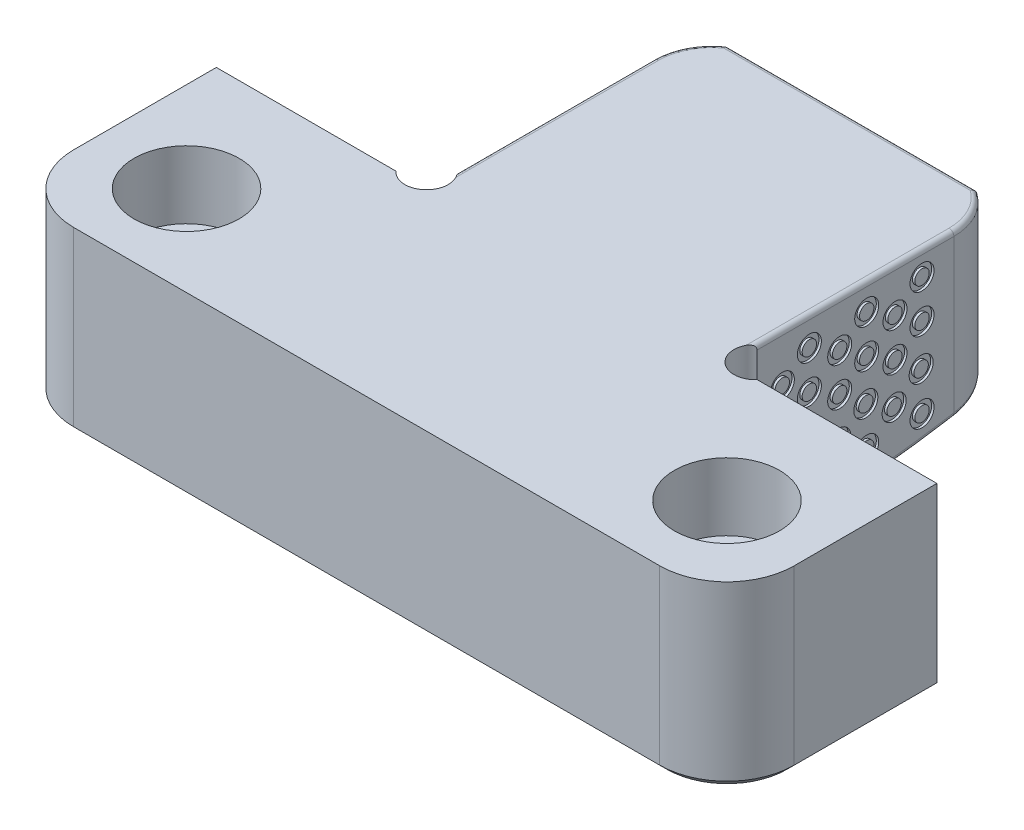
from build123d import *

# Parameters (mm, degrees)
BOSS_EXTRUDE1_DEPTH     = 19.0246
CUT_EXTRUDE1_DEPTH      = 52.583372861
SKETCH3_R               = 2.286
CUT_EXTRUDE2_DEPTH      = 52.583372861
CUT_EXTRUDE3_DEPTH      = 84.759622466
FILLET1_R               = 7.112
FILLET2_R               = 0.508
CHAMFER3_SIZE           = 0.762
F_1_4_CBORE_D           = 6.7564
F_1_4_CBORE_CBORE_D     = 11.1125
F_1_4_CBORE_CBORE_DEPTH = 7.14375
SKETCH8_R               = 1.27
SKETCH8_R_2             = 0.762
CUT_EXTRUDE4_DEPTH      = 0.254


with BuildPart() as part:
    # Sketch1 → Boss-Extrude1 (new body)
    with BuildSketch(Plane(origin=(0, 0, 0), x_dir=(1, 0, 0), z_dir=(0, 1, 0))):
        Polygon((-38.1, -22.1996), (38.1, -22.1996), (38.1, 0), (15.87246, 0), (15.87246, 29.1084), (-15.87246, 29.1084), (-15.87246, 0), (-38.1, 0), align=None)
    extrude(amount=-BOSS_EXTRUDE1_DEPTH)

    # Sketch2 → Cut-Extrude1 (cut, through all)
    with BuildSketch(Plane(origin=(0, 0, 0), x_dir=(1, 0, 0), z_dir=(0, 1, 0))):
        with BuildLine():
            Line((15.87246, 22.7584), (15.87246, 24.0284))
            ThreePointArc((15.87246, 24.0284), (15.164947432, 26.897353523), (13.20465617, 29.1084))
            Line((13.20465617, 29.1084), (-13.20465617, 29.1084))
            ThreePointArc((-13.20465617, 29.1084), (-15.164947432, 26.897353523), (-15.87246, 24.0284))
            Line((-15.87246, 24.0284), (-15.87246, 22.7584))
            Line((-15.87246, 22.7584), (-25.4, 22.7584))
            Line((-25.4, 22.7584), (-25.4, 35.4584))
            Line((-25.4, 35.4584), (25.4, 35.4584))
            Line((25.4, 35.4584), (25.4, 22.7584))
            Line((25.4, 22.7584), (15.87246, 22.7584))
        make_face()
    extrude(amount=-CUT_EXTRUDE1_DEPTH, mode=Mode.SUBTRACT)

    # Sketch3 → Cut-Extrude2 (cut, through all)
    with BuildSketch(Plane(origin=(0, 0, 0), x_dir=(1, 0, 0), z_dir=(0, 1, 0))):
        with Locations((17.39646, 1.524)):
            Circle(SKETCH3_R)
        with Locations((-17.39646, 1.524)):
            Circle(SKETCH3_R)
    extrude(amount=-CUT_EXTRUDE2_DEPTH, mode=Mode.SUBTRACT)

    # Sketch5 → Cut-Extrude3 (cut, through all)
    with BuildSketch(Plane(origin=(38.1, 0, 0), x_dir=(0, 0, -1), z_dir=(1, 0, 0))):
        with BuildLine():
            Line((0, -18.7706), (0, -47.283879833))
            Line((0, -47.283879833), (50.8, -47.283879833))
            Line((50.8, -47.283879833), (50.8, -9.183879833))
            ThreePointArc((50.8, -9.183879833), (28.385259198, -16.348251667), (4.9784, -18.7706))
            Line((4.9784, -18.7706), (0, -18.7706))
        make_face()
    extrude(amount=-CUT_EXTRUDE3_DEPTH, mode=Mode.SUBTRACT)

    # Fillet1
    fillet1_edges = [part.edges().sort_by_distance(p)[0] for p in [
        (38.1, -9.5123, 22.1996),
        (-38.1, -9.5123, 22.1996),
    ]]
    fillet(fillet1_edges, radius=FILLET1_R)

    # Fillet2
    fillet2_edges = [part.edges().sort_by_distance(p)[0] for p in [
        (0, 0, -29.1084),
        (-15.87246, 0, -13.628141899),
        (-15.164947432, 0, -26.897353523),
        (15.164947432, 0, -26.897353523),
        (15.87246, 0, -13.628141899),
        (15.167390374, -16.650159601, -26.892696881),
        (-15.87246, -18.370228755, -14.53688155),
        (0, -16.194514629, -29.1084),
        (15.87246, -18.370228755, -14.53688155),
        (15.87246, -18.7706, -4.103141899),
        (-15.87246, -18.7706, -4.103141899),
        (-15.167390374, -16.650159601, -26.892696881),
    ]]
    fillet(fillet2_edges, radius=FILLET2_R)

    # Chamfer3
    chamfer3_edges = [part.edges().sort_by_distance(p)[0] for p in [
        (0, -19.0246, 22.1996),
        (38.1, -19.0246, 7.5438),
        (36.016943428, -19.0246, 20.116543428),
        (-36.016943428, -19.0246, 20.116543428),
        (-38.1, -19.0246, 7.5438),
    ]]
    chamfer(chamfer3_edges, length=CHAMFER3_SIZE)

    # 1_4_ CBORE (through all)
    with Locations(Plane(origin=(0, 0, 0), x_dir=(-1, 0, 0), z_dir=(0, 1, 0))):
        with Locations((28.575, 12.6746), (-28.575, 12.6746)):
            CounterBoreHole(F_1_4_CBORE_D / 2, F_1_4_CBORE_CBORE_D / 2, F_1_4_CBORE_CBORE_DEPTH)

    # Sketch8 → Cut-Extrude4 (cut)
    # profile 1 of 21: a face of its own
    with BuildSketch(Plane(origin=(15.87246, 0, 0), x_dir=(0, 0, -1), z_dir=(1, 0, 0))):
        with Locations((20.659548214, -2.541638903)):
            Circle(SKETCH8_R)
        with Locations((20.659548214, -2.541638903)):
            Circle(SKETCH8_R_2, mode=Mode.SUBTRACT)
    # profile 2 of 21: a face of its own
    with BuildSketch(Plane(origin=(15.87246, 0, 0), x_dir=(0, 0, -1), z_dir=(1, 0, 0))):
        with Locations((20.659548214, -15.078409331)):
            Circle(SKETCH8_R)
        with Locations((20.659548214, -15.078409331)):
            Circle(SKETCH8_R_2, mode=Mode.SUBTRACT)
    # profile 3 of 21: a face of its own
    with BuildSketch(Plane(origin=(15.87246, 0, 0), x_dir=(0, 0, -1), z_dir=(1, 0, 0))):
        with Locations((20.564931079, -10.915255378)):
            Circle(SKETCH8_R)
        with Locations((20.564931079, -10.915255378)):
            Circle(SKETCH8_R_2, mode=Mode.SUBTRACT)
    # profile 4 of 21: a face of its own
    with BuildSketch(Plane(origin=(15.87246, 0, 0), x_dir=(0, 0, -1), z_dir=(1, 0, 0))):
        with Locations((20.659548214, -6.610175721)):
            Circle(SKETCH8_R)
        with Locations((20.659548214, -6.610175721)):
            Circle(SKETCH8_R_2, mode=Mode.SUBTRACT)
    # profile 5 of 21: a face of its own
    with BuildSketch(Plane(origin=(15.87246, 0, 0), x_dir=(0, 0, -1), z_dir=(1, 0, 0))):
        with Locations((17.800309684, -4.616657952)):
            Circle(SKETCH8_R)
        with Locations((17.800309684, -4.616657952)):
            Circle(SKETCH8_R_2, mode=Mode.SUBTRACT)
    # profile 6 of 21: a face of its own
    with BuildSketch(Plane(origin=(15.87246, 0, 0), x_dir=(0, 0, -1), z_dir=(1, 0, 0))):
        with Locations((14.808726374, -2.819984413)):
            Circle(SKETCH8_R)
        with Locations((14.808726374, -2.819984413)):
            Circle(SKETCH8_R_2, mode=Mode.SUBTRACT)
    # profile 7 of 21: a face of its own
    with BuildSketch(Plane(origin=(15.87246, 0, 0), x_dir=(0, 0, -1), z_dir=(1, 0, 0))):
        with Locations((17.705692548, -12.990274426)):
            Circle(SKETCH8_R)
        with Locations((17.705692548, -12.990274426)):
            Circle(SKETCH8_R_2, mode=Mode.SUBTRACT)
    # profile 8 of 21: a face of its own
    with BuildSketch(Plane(origin=(15.87246, 0, 0), x_dir=(0, 0, -1), z_dir=(1, 0, 0))):
        with Locations((17.800309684, -8.68519477)):
            Circle(SKETCH8_R)
        with Locations((17.800309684, -8.68519477)):
            Circle(SKETCH8_R_2, mode=Mode.SUBTRACT)
    # profile 9 of 21: a face of its own
    with BuildSketch(Plane(origin=(15.87246, 0, 0), x_dir=(0, 0, -1), z_dir=(1, 0, 0))):
        with Locations((14.808726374, -15.356754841)):
            Circle(SKETCH8_R)
        with Locations((14.808726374, -15.356754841)):
            Circle(SKETCH8_R_2, mode=Mode.SUBTRACT)
    # profile 10 of 21: a face of its own
    with BuildSketch(Plane(origin=(15.87246, 0, 0), x_dir=(0, 0, -1), z_dir=(1, 0, 0))):
        with Locations((14.714109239, -11.193600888)):
            Circle(SKETCH8_R)
        with Locations((14.714109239, -11.193600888)):
            Circle(SKETCH8_R_2, mode=Mode.SUBTRACT)
    # profile 11 of 21: a face of its own
    with BuildSketch(Plane(origin=(15.87246, 0, 0), x_dir=(0, 0, -1), z_dir=(1, 0, 0))):
        with Locations((14.808726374, -6.888521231)):
            Circle(SKETCH8_R)
        with Locations((14.808726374, -6.888521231)):
            Circle(SKETCH8_R_2, mode=Mode.SUBTRACT)
    # profile 12 of 21: a face of its own
    with BuildSketch(Plane(origin=(15.87246, 0, 0), x_dir=(0, 0, -1), z_dir=(1, 0, 0))):
        with Locations((11.949487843, -4.895003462)):
            Circle(SKETCH8_R)
        with Locations((11.949487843, -4.895003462)):
            Circle(SKETCH8_R_2, mode=Mode.SUBTRACT)
    # profile 13 of 21: a face of its own
    with BuildSketch(Plane(origin=(15.87246, 0, 0), x_dir=(0, 0, -1), z_dir=(1, 0, 0))):
        with Locations((11.854870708, -13.268619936)):
            Circle(SKETCH8_R)
        with Locations((11.854870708, -13.268619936)):
            Circle(SKETCH8_R_2, mode=Mode.SUBTRACT)
    # profile 14 of 21: a face of its own
    with BuildSketch(Plane(origin=(15.87246, 0, 0), x_dir=(0, 0, -1), z_dir=(1, 0, 0))):
        with Locations((11.949487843, -8.96354028)):
            Circle(SKETCH8_R)
        with Locations((11.949487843, -8.96354028)):
            Circle(SKETCH8_R_2, mode=Mode.SUBTRACT)
    # profile 15 of 21: a face of its own
    with BuildSketch(Plane(origin=(15.87246, 0, 0), x_dir=(0, 0, -1), z_dir=(1, 0, 0))):
        with Locations((8.743678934, -3.074561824)):
            Circle(SKETCH8_R)
        with Locations((8.743678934, -3.074561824)):
            Circle(SKETCH8_R_2, mode=Mode.SUBTRACT)
    # profile 16 of 21: a face of its own
    with BuildSketch(Plane(origin=(15.87246, 0, 0), x_dir=(0, 0, -1), z_dir=(1, 0, 0))):
        with Locations((8.743678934, -15.611332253)):
            Circle(SKETCH8_R)
        with Locations((8.743678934, -15.611332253)):
            Circle(SKETCH8_R_2, mode=Mode.SUBTRACT)
    # profile 17 of 21: a face of its own
    with BuildSketch(Plane(origin=(15.87246, 0, 0), x_dir=(0, 0, -1), z_dir=(1, 0, 0))):
        with Locations((8.649061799, -11.448178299)):
            Circle(SKETCH8_R)
        with Locations((8.649061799, -11.448178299)):
            Circle(SKETCH8_R_2, mode=Mode.SUBTRACT)
    # profile 18 of 21: a face of its own
    with BuildSketch(Plane(origin=(15.87246, 0, 0), x_dir=(0, 0, -1), z_dir=(1, 0, 0))):
        with Locations((8.743678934, -7.143098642)):
            Circle(SKETCH8_R)
        with Locations((8.743678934, -7.143098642)):
            Circle(SKETCH8_R_2, mode=Mode.SUBTRACT)
    # profile 19 of 21: a face of its own
    with BuildSketch(Plane(origin=(15.87246, 0, 0), x_dir=(0, 0, -1), z_dir=(1, 0, 0))):
        with Locations((5.884440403, -5.149580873)):
            Circle(SKETCH8_R)
        with Locations((5.884440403, -5.149580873)):
            Circle(SKETCH8_R_2, mode=Mode.SUBTRACT)
    # profile 20 of 21: a face of its own
    with BuildSketch(Plane(origin=(15.87246, 0, 0), x_dir=(0, 0, -1), z_dir=(1, 0, 0))):
        with Locations((5.789823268, -13.523197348)):
            Circle(SKETCH8_R)
        with Locations((5.789823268, -13.523197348)):
            Circle(SKETCH8_R_2, mode=Mode.SUBTRACT)
    # profile 21 of 21: a face of its own
    with BuildSketch(Plane(origin=(15.87246, 0, 0), x_dir=(0, 0, -1), z_dir=(1, 0, 0))):
        with Locations((5.884440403, -9.218117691)):
            Circle(SKETCH8_R)
        with Locations((5.884440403, -9.218117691)):
            Circle(SKETCH8_R_2, mode=Mode.SUBTRACT)
    cut_extrude4 = extrude(amount=-CUT_EXTRUDE4_DEPTH, mode=Mode.SUBTRACT)

    # Mirror1: Cut-Extrude4 across plane
    add(cut_extrude4.mirror(Plane(origin=(0, 0, 0), x_dir=(0, 0, 1), z_dir=(1, 0, 0))), mode=Mode.SUBTRACT)


solid = part.part
